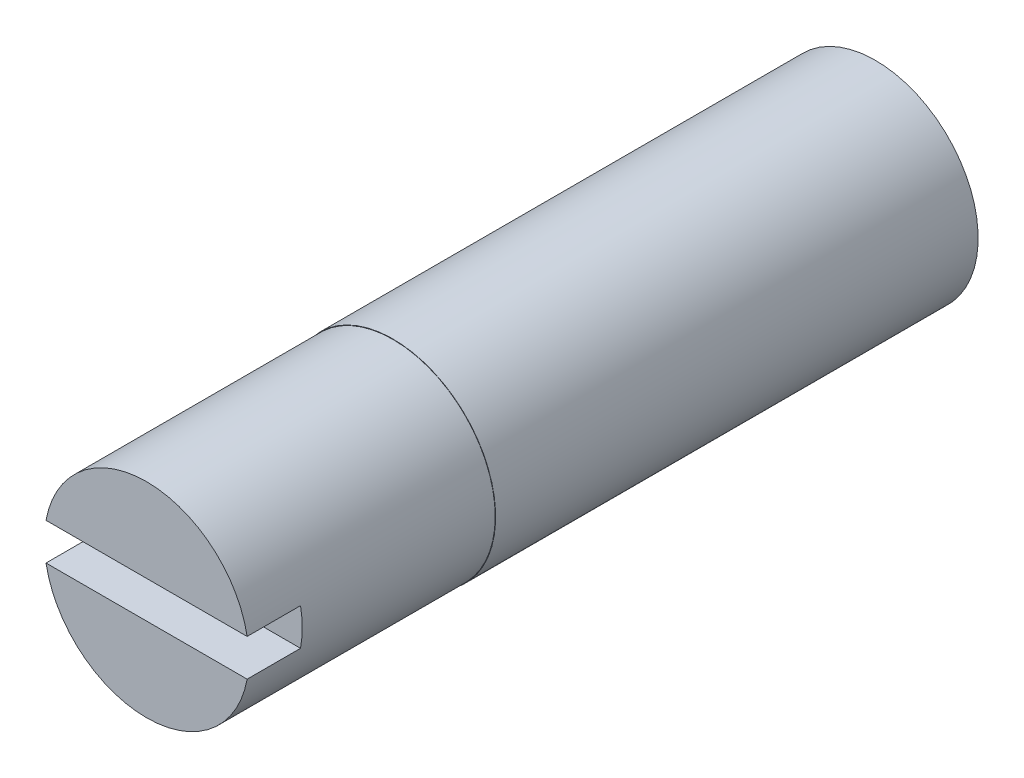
ISO-10303-21;
HEADER;
FILE_DESCRIPTION(('STEP AP214'),'2;1');
FILE_NAME('part.step','',(''),(''),'','','');
FILE_SCHEMA(('AUTOMOTIVE_DESIGN { 1 0 10303 214 1 1 1 1 }'));
ENDSEC;
DATA;
#1=APPLICATION_CONTEXT('core data for automotive mechanical design processes');
#2=APPLICATION_PROTOCOL_DEFINITION('international standard','automotive_design',2000,#1);
#3=PRODUCT_CONTEXT('',#1,'mechanical');
#4=PRODUCT('Part','Part','',(#3));
#5=PRODUCT_RELATED_PRODUCT_CATEGORY('part','',(#4));
#6=PRODUCT_DEFINITION_FORMATION('','',#4);
#7=PRODUCT_DEFINITION_CONTEXT('part definition',#1,'design');
#8=PRODUCT_DEFINITION('design','',#6,#7);
#9=PRODUCT_DEFINITION_SHAPE('','',#8);
#10=(LENGTH_UNIT() NAMED_UNIT(*) SI_UNIT(.MILLI.,.METRE.));
#11=(NAMED_UNIT(*) PLANE_ANGLE_UNIT() SI_UNIT($,.RADIAN.));
#12=(NAMED_UNIT(*) SI_UNIT($,.STERADIAN.) SOLID_ANGLE_UNIT());
#13=UNCERTAINTY_MEASURE_WITH_UNIT(LENGTH_MEASURE(1.E-05),#10,'distance_accuracy_value','');
#14=(GEOMETRIC_REPRESENTATION_CONTEXT(3) GLOBAL_UNCERTAINTY_ASSIGNED_CONTEXT((#13)) GLOBAL_UNIT_ASSIGNED_CONTEXT((#10,
#11,#12)) REPRESENTATION_CONTEXT('',''));
#15=CARTESIAN_POINT('',(0.,0.,0.));
#16=DIRECTION('',(0.,0.,1.));
#17=DIRECTION('',(1.,0.,0.));
#18=AXIS2_PLACEMENT_3D('',#15,#16,#17);
#19=CARTESIAN_POINT('',(0.,0.,6.));
#20=DIRECTION('',(0.,0.,-1.));
#21=DIRECTION('',(-1.,0.,0.));
#22=AXIS2_PLACEMENT_3D('',#19,#20,#21);
#23=CYLINDRICAL_SURFACE('',#22,2.49);
#24=CARTESIAN_POINT('',(0.,0.,0.));
#25=DIRECTION('',(0.,0.,1.));
#26=DIRECTION('',(1.,0.,0.));
#27=AXIS2_PLACEMENT_3D('',#24,#25,#26);
#28=CIRCLE('',#27,2.49);
#29=CARTESIAN_POINT('',(2.49,0.,0.));
#30=VERTEX_POINT('',#29);
#31=EDGE_CURVE('E101',#30,#30,#28,.T.);
#32=ORIENTED_EDGE('',*,*,#31,.T.);
#33=EDGE_LOOP('',(#32));
#34=FACE_BOUND('',#33,.T.);
#35=DIRECTION('',(0.,0.,-1.));
#36=VECTOR('',#35,1.);
#37=CARTESIAN_POINT('',(-2.44899979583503,-0.450000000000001,6.));
#38=LINE('',#37,#36);
#39=CARTESIAN_POINT('',(-2.44899979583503,-0.450000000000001,4.7));
#40=VERTEX_POINT('',#39);
#41=CARTESIAN_POINT('',(-2.44899979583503,-0.450000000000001,6.));
#42=VERTEX_POINT('',#41);
#43=EDGE_CURVE('E107',#40,#42,#38,.F.);
#44=ORIENTED_EDGE('',*,*,#43,.F.);
#45=CARTESIAN_POINT('',(0.,0.,4.7));
#46=DIRECTION('',(0.,0.,1.));
#47=DIRECTION('',(1.,0.,0.));
#48=AXIS2_PLACEMENT_3D('',#45,#46,#47);
#49=CIRCLE('',#48,2.49);
#50=CARTESIAN_POINT('',(-2.44899979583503,0.450000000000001,4.7));
#51=VERTEX_POINT('',#50);
#52=EDGE_CURVE('E11',#51,#40,#49,.T.);
#53=ORIENTED_EDGE('',*,*,#52,.F.);
#54=DIRECTION('',(0.,0.,-1.));
#55=VECTOR('',#54,1.);
#56=CARTESIAN_POINT('',(-2.44899979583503,0.450000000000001,6.));
#57=LINE('',#56,#55);
#58=CARTESIAN_POINT('',(-2.44899979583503,0.450000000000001,6.));
#59=VERTEX_POINT('',#58);
#60=EDGE_CURVE('E103',#51,#59,#57,.F.);
#61=ORIENTED_EDGE('',*,*,#60,.T.);
#62=CARTESIAN_POINT('',(0.,0.,6.));
#63=DIRECTION('',(0.,0.,1.));
#64=DIRECTION('',(1.,0.,0.));
#65=AXIS2_PLACEMENT_3D('',#62,#63,#64);
#66=CIRCLE('',#65,2.49);
#67=CARTESIAN_POINT('',(2.44899979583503,0.45,6.));
#68=VERTEX_POINT('',#67);
#69=EDGE_CURVE('E46',#68,#59,#66,.T.);
#70=ORIENTED_EDGE('',*,*,#69,.F.);
#71=DIRECTION('',(0.,0.,1.));
#72=VECTOR('',#71,1.);
#73=CARTESIAN_POINT('',(2.44899979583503,0.45,4.7));
#74=LINE('',#73,#72);
#75=CARTESIAN_POINT('',(2.44899979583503,0.45,4.7));
#76=VERTEX_POINT('',#75);
#77=EDGE_CURVE('E53',#76,#68,#74,.T.);
#78=ORIENTED_EDGE('',*,*,#77,.F.);
#79=CARTESIAN_POINT('',(0.,0.,4.7));
#80=DIRECTION('',(0.,0.,1.));
#81=DIRECTION('',(1.,0.,0.));
#82=AXIS2_PLACEMENT_3D('',#79,#80,#81);
#83=CIRCLE('',#82,2.49);
#84=CARTESIAN_POINT('',(2.44899979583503,-0.45,4.7));
#85=VERTEX_POINT('',#84);
#86=EDGE_CURVE('E92',#85,#76,#83,.T.);
#87=ORIENTED_EDGE('',*,*,#86,.F.);
#88=DIRECTION('',(0.,0.,1.));
#89=VECTOR('',#88,1.);
#90=CARTESIAN_POINT('',(2.44899979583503,-0.45,4.7));
#91=LINE('',#90,#89);
#92=CARTESIAN_POINT('',(2.44899979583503,-0.45,6.));
#93=VERTEX_POINT('',#92);
#94=EDGE_CURVE('E78',#85,#93,#91,.T.);
#95=ORIENTED_EDGE('',*,*,#94,.T.);
#96=EDGE_CURVE('E109',#42,#93,#66,.T.);
#97=ORIENTED_EDGE('',*,*,#96,.F.);
#98=EDGE_LOOP('',(#44,#53,#61,#70,#78,#87,#95,#97));
#99=FACE_BOUND('',#98,.T.);
#100=ADVANCED_FACE('F39',(#34,#99),#23,.T.);
#101=CARTESIAN_POINT('',(0.,0.,6.));
#102=DIRECTION('',(0.,0.,1.));
#103=DIRECTION('',(1.,0.,0.));
#104=AXIS2_PLACEMENT_3D('',#101,#102,#103);
#105=PLANE('',#104);
#106=ORIENTED_EDGE('',*,*,#96,.T.);
#107=DIRECTION('',(-1.,0.,0.));
#108=VECTOR('',#107,1.);
#109=CARTESIAN_POINT('',(0.,-0.45,6.));
#110=LINE('',#109,#108);
#111=EDGE_CURVE('E83',#93,#42,#110,.T.);
#112=ORIENTED_EDGE('',*,*,#111,.T.);
#113=EDGE_LOOP('',(#106,#112));
#114=FACE_BOUND('',#113,.T.);
#115=ADVANCED_FACE('F136',(#114),#105,.T.);
#116=DIRECTION('',(-1.,0.,0.));
#117=VECTOR('',#116,1.);
#118=CARTESIAN_POINT('',(0.,0.45,6.));
#119=LINE('',#118,#117);
#120=EDGE_CURVE('E93',#68,#59,#119,.T.);
#121=ORIENTED_EDGE('',*,*,#120,.F.);
#122=ORIENTED_EDGE('',*,*,#69,.T.);
#123=EDGE_LOOP('',(#121,#122));
#124=FACE_BOUND('',#123,.T.);
#125=ADVANCED_FACE('F140',(#124),#105,.T.);
#126=CARTESIAN_POINT('',(0.,0.,4.7));
#127=DIRECTION('',(0.,0.,1.));
#128=DIRECTION('',(1.,0.,0.));
#129=AXIS2_PLACEMENT_3D('',#126,#127,#128);
#130=PLANE('',#129);
#131=ORIENTED_EDGE('',*,*,#52,.T.);
#132=DIRECTION('',(-1.,0.,0.));
#133=VECTOR('',#132,1.);
#134=CARTESIAN_POINT('',(0.,-0.45,4.7));
#135=LINE('',#134,#133);
#136=EDGE_CURVE('E80',#85,#40,#135,.T.);
#137=ORIENTED_EDGE('',*,*,#136,.F.);
#138=ORIENTED_EDGE('',*,*,#86,.T.);
#139=DIRECTION('',(-1.,0.,0.));
#140=VECTOR('',#139,1.);
#141=CARTESIAN_POINT('',(0.,0.45,4.7));
#142=LINE('',#141,#140);
#143=EDGE_CURVE('E88',#76,#51,#142,.T.);
#144=ORIENTED_EDGE('',*,*,#143,.T.);
#145=EDGE_LOOP('',(#131,#137,#138,#144));
#146=FACE_BOUND('',#145,.T.);
#147=ADVANCED_FACE('F91',(#146),#130,.T.);
#148=CARTESIAN_POINT('',(0.,-0.45,4.7));
#149=DIRECTION('',(0.,1.,0.));
#150=DIRECTION('',(-1.,0.,0.));
#151=AXIS2_PLACEMENT_3D('',#148,#149,#150);
#152=PLANE('',#151);
#153=ORIENTED_EDGE('',*,*,#43,.T.);
#154=ORIENTED_EDGE('',*,*,#111,.F.);
#155=ORIENTED_EDGE('',*,*,#94,.F.);
#156=ORIENTED_EDGE('',*,*,#136,.T.);
#157=EDGE_LOOP('',(#153,#154,#155,#156));
#158=FACE_BOUND('',#157,.T.);
#159=ADVANCED_FACE('F79',(#158),#152,.T.);
#160=CARTESIAN_POINT('',(0.,0.45,4.7));
#161=DIRECTION('',(0.,1.,0.));
#162=DIRECTION('',(-1.,0.,0.));
#163=AXIS2_PLACEMENT_3D('',#160,#161,#162);
#164=PLANE('',#163);
#165=ORIENTED_EDGE('',*,*,#143,.F.);
#166=ORIENTED_EDGE('',*,*,#77,.T.);
#167=ORIENTED_EDGE('',*,*,#120,.T.);
#168=ORIENTED_EDGE('',*,*,#60,.F.);
#169=EDGE_LOOP('',(#165,#166,#167,#168));
#170=FACE_BOUND('',#169,.T.);
#171=ADVANCED_FACE('F149',(#170),#164,.F.);
#172=CARTESIAN_POINT('',(0.,0.,-11.75));
#173=DIRECTION('',(0.,0.,1.));
#174=DIRECTION('',(1.,0.,0.));
#175=AXIS2_PLACEMENT_3D('',#172,#173,#174);
#176=CYLINDRICAL_SURFACE('',#175,2.5);
#177=CARTESIAN_POINT('',(0.,0.,-11.75));
#178=DIRECTION('',(0.,0.,-1.));
#179=DIRECTION('',(-1.,0.,0.));
#180=AXIS2_PLACEMENT_3D('',#177,#178,#179);
#181=CIRCLE('',#180,2.5);
#182=CARTESIAN_POINT('',(-2.5,0.,-11.75));
#183=VERTEX_POINT('',#182);
#184=EDGE_CURVE('E112',#183,#183,#181,.T.);
#185=ORIENTED_EDGE('',*,*,#184,.F.);
#186=EDGE_LOOP('',(#185));
#187=FACE_BOUND('',#186,.T.);
#188=CARTESIAN_POINT('',(0.,0.,0.));
#189=DIRECTION('',(0.,0.,-1.));
#190=DIRECTION('',(-1.,0.,0.));
#191=AXIS2_PLACEMENT_3D('',#188,#189,#190);
#192=CIRCLE('',#191,2.5);
#193=CARTESIAN_POINT('',(-2.5,0.,0.));
#194=VERTEX_POINT('',#193);
#195=EDGE_CURVE('E116',#194,#194,#192,.T.);
#196=ORIENTED_EDGE('',*,*,#195,.T.);
#197=EDGE_LOOP('',(#196));
#198=FACE_BOUND('',#197,.T.);
#199=ADVANCED_FACE('F123',(#187,#198),#176,.T.);
#200=CARTESIAN_POINT('',(0.,0.,-11.75));
#201=DIRECTION('',(0.,0.,-1.));
#202=DIRECTION('',(-1.,0.,0.));
#203=AXIS2_PLACEMENT_3D('',#200,#201,#202);
#204=PLANE('',#203);
#205=ORIENTED_EDGE('',*,*,#184,.T.);
#206=EDGE_LOOP('',(#205));
#207=FACE_BOUND('',#206,.T.);
#208=ADVANCED_FACE('F127',(#207),#204,.T.);
#209=CARTESIAN_POINT('',(0.,0.,0.));
#210=DIRECTION('',(0.,0.,-1.));
#211=DIRECTION('',(-1.,0.,0.));
#212=AXIS2_PLACEMENT_3D('',#209,#210,#211);
#213=PLANE('',#212);
#214=ORIENTED_EDGE('',*,*,#31,.F.);
#215=EDGE_LOOP('',(#214));
#216=FACE_BOUND('',#215,.T.);
#217=ORIENTED_EDGE('',*,*,#195,.F.);
#218=EDGE_LOOP('',(#217));
#219=FACE_BOUND('',#218,.T.);
#220=ADVANCED_FACE('F125',(#216,#219),#213,.F.);
#221=CLOSED_SHELL('',(#100,#115,#125,#147,#159,#171,#199,#208,#220));
#222=MANIFOLD_SOLID_BREP('B2',#221);
#223=ADVANCED_BREP_SHAPE_REPRESENTATION('',(#18,#222),#14);
#224=SHAPE_DEFINITION_REPRESENTATION(#9,#223);
ENDSEC;
END-ISO-10303-21;
